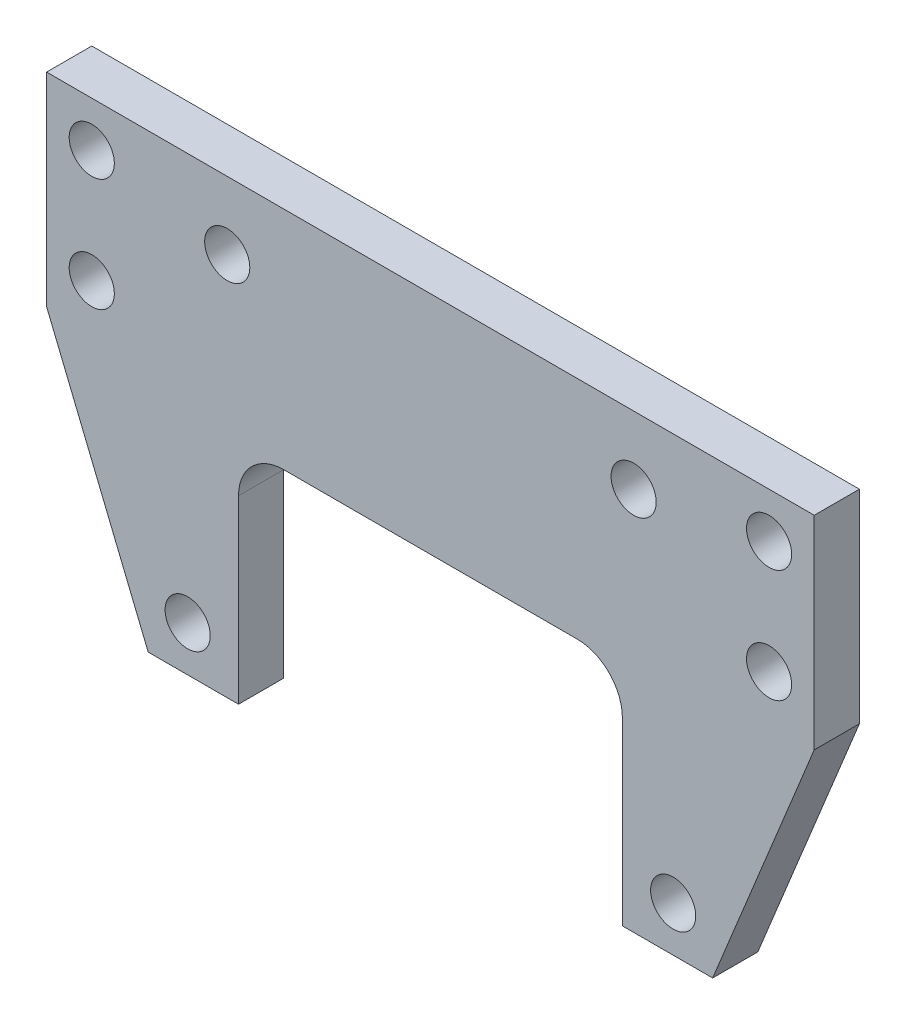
ISO-10303-21;
HEADER;
FILE_DESCRIPTION(('STEP AP214'),'2;1');
FILE_NAME('part.step','',(''),(''),'','','');
FILE_SCHEMA(('AUTOMOTIVE_DESIGN { 1 0 10303 214 1 1 1 1 }'));
ENDSEC;
DATA;
#1=APPLICATION_CONTEXT('core data for automotive mechanical design processes');
#2=APPLICATION_PROTOCOL_DEFINITION('international standard','automotive_design',2000,#1);
#3=PRODUCT_CONTEXT('',#1,'mechanical');
#4=PRODUCT('Part','Part','',(#3));
#5=PRODUCT_RELATED_PRODUCT_CATEGORY('part','',(#4));
#6=PRODUCT_DEFINITION_FORMATION('','',#4);
#7=PRODUCT_DEFINITION_CONTEXT('part definition',#1,'design');
#8=PRODUCT_DEFINITION('design','',#6,#7);
#9=PRODUCT_DEFINITION_SHAPE('','',#8);
#10=(LENGTH_UNIT() NAMED_UNIT(*) SI_UNIT(.MILLI.,.METRE.));
#11=(NAMED_UNIT(*) PLANE_ANGLE_UNIT() SI_UNIT($,.RADIAN.));
#12=(NAMED_UNIT(*) SI_UNIT($,.STERADIAN.) SOLID_ANGLE_UNIT());
#13=UNCERTAINTY_MEASURE_WITH_UNIT(LENGTH_MEASURE(1.E-05),#10,'distance_accuracy_value','');
#14=(GEOMETRIC_REPRESENTATION_CONTEXT(3) GLOBAL_UNCERTAINTY_ASSIGNED_CONTEXT((#13)) GLOBAL_UNIT_ASSIGNED_CONTEXT((#10,
#11,#12)) REPRESENTATION_CONTEXT('',''));
#15=CARTESIAN_POINT('',(0.,0.,0.));
#16=DIRECTION('',(0.,0.,1.));
#17=DIRECTION('',(1.,0.,0.));
#18=AXIS2_PLACEMENT_3D('',#15,#16,#17);
#19=CARTESIAN_POINT('',(0.,0.,6.35));
#20=DIRECTION('',(0.,0.,-1.));
#21=DIRECTION('',(-1.,0.,0.));
#22=AXIS2_PLACEMENT_3D('',#19,#20,#21);
#23=PLANE('',#22);
#24=CARTESIAN_POINT('',(47.625,-6.35,6.35));
#25=DIRECTION('',(0.,0.,1.));
#26=DIRECTION('',(1.,0.,0.));
#27=AXIS2_PLACEMENT_3D('',#24,#25,#26);
#28=CIRCLE('',#27,3.175);
#29=CARTESIAN_POINT('',(50.8,-6.35,6.35));
#30=VERTEX_POINT('',#29);
#31=EDGE_CURVE('E318',#30,#30,#28,.T.);
#32=ORIENTED_EDGE('',*,*,#31,.F.);
#33=EDGE_LOOP('',(#32));
#34=FACE_BOUND('',#33,.T.);
#35=CARTESIAN_POINT('',(-47.625,-22.225,6.35));
#36=DIRECTION('',(0.,0.,1.));
#37=DIRECTION('',(1.,0.,0.));
#38=AXIS2_PLACEMENT_3D('',#35,#36,#37);
#39=CIRCLE('',#38,3.175);
#40=CARTESIAN_POINT('',(-44.45,-22.225,6.35));
#41=VERTEX_POINT('',#40);
#42=EDGE_CURVE('E306',#41,#41,#39,.T.);
#43=ORIENTED_EDGE('',*,*,#42,.F.);
#44=EDGE_LOOP('',(#43));
#45=FACE_BOUND('',#44,.T.);
#46=CARTESIAN_POINT('',(28.575,-9.525,6.35));
#47=DIRECTION('',(0.,0.,1.));
#48=DIRECTION('',(1.,0.,0.));
#49=AXIS2_PLACEMENT_3D('',#46,#47,#48);
#50=CIRCLE('',#49,3.175);
#51=CARTESIAN_POINT('',(31.75,-9.525,6.35));
#52=VERTEX_POINT('',#51);
#53=EDGE_CURVE('E294',#52,#52,#50,.T.);
#54=ORIENTED_EDGE('',*,*,#53,.F.);
#55=EDGE_LOOP('',(#54));
#56=FACE_BOUND('',#55,.T.);
#57=CARTESIAN_POINT('',(-34.1376,-57.15,6.35));
#58=DIRECTION('',(0.,0.,1.));
#59=DIRECTION('',(1.,0.,0.));
#60=AXIS2_PLACEMENT_3D('',#57,#58,#59);
#61=CIRCLE('',#60,3.175);
#62=CARTESIAN_POINT('',(-30.9626,-57.15,6.35));
#63=VERTEX_POINT('',#62);
#64=EDGE_CURVE('E166',#63,#63,#61,.T.);
#65=ORIENTED_EDGE('',*,*,#64,.F.);
#66=EDGE_LOOP('',(#65));
#67=FACE_BOUND('',#66,.T.);
#68=DIRECTION('',(0.,1.,0.));
#69=VECTOR('',#68,1.);
#70=CARTESIAN_POINT('',(-26.9875,-31.75,6.35));
#71=LINE('',#70,#69);
#72=CARTESIAN_POINT('',(-26.9875,-63.5,6.35));
#73=VERTEX_POINT('',#72);
#74=CARTESIAN_POINT('',(-26.9875,-38.1,6.35));
#75=VERTEX_POINT('',#74);
#76=EDGE_CURVE('E185',#73,#75,#71,.T.);
#77=ORIENTED_EDGE('',*,*,#76,.T.);
#78=CARTESIAN_POINT('',(-20.6375,-38.1,6.35));
#79=DIRECTION('',(0.,0.,-1.));
#80=DIRECTION('',(-1.,0.,0.));
#81=AXIS2_PLACEMENT_3D('',#78,#79,#80);
#82=CIRCLE('',#81,6.35);
#83=CARTESIAN_POINT('',(-20.6375,-31.75,6.35));
#84=VERTEX_POINT('',#83);
#85=EDGE_CURVE('E11',#75,#84,#82,.T.);
#86=ORIENTED_EDGE('',*,*,#85,.T.);
#87=DIRECTION('',(1.,0.,0.));
#88=VECTOR('',#87,1.);
#89=CARTESIAN_POINT('',(26.9875,-31.75,6.35));
#90=LINE('',#89,#88);
#91=CARTESIAN_POINT('',(20.6375,-31.75,6.35));
#92=VERTEX_POINT('',#91);
#93=EDGE_CURVE('E132',#84,#92,#90,.T.);
#94=ORIENTED_EDGE('',*,*,#93,.T.);
#95=CARTESIAN_POINT('',(20.6375,-38.1,6.35));
#96=DIRECTION('',(0.,0.,-1.));
#97=DIRECTION('',(-1.,0.,0.));
#98=AXIS2_PLACEMENT_3D('',#95,#96,#97);
#99=CIRCLE('',#98,6.35);
#100=CARTESIAN_POINT('',(26.9875,-38.1,6.35));
#101=VERTEX_POINT('',#100);
#102=EDGE_CURVE('E128',#92,#101,#99,.T.);
#103=ORIENTED_EDGE('',*,*,#102,.T.);
#104=DIRECTION('',(0.,-1.,0.));
#105=VECTOR('',#104,1.);
#106=CARTESIAN_POINT('',(26.9875,-63.5,6.35));
#107=LINE('',#106,#105);
#108=CARTESIAN_POINT('',(26.9875,-63.5,6.35));
#109=VERTEX_POINT('',#108);
#110=EDGE_CURVE('E120',#101,#109,#107,.T.);
#111=ORIENTED_EDGE('',*,*,#110,.T.);
#112=DIRECTION('',(1.,0.,0.));
#113=VECTOR('',#112,1.);
#114=CARTESIAN_POINT('',(39.6875,-63.5,6.35));
#115=LINE('',#114,#113);
#116=CARTESIAN_POINT('',(39.6875,-63.5,6.35));
#117=VERTEX_POINT('',#116);
#118=EDGE_CURVE('E124',#109,#117,#115,.T.);
#119=ORIENTED_EDGE('',*,*,#118,.T.);
#120=DIRECTION('',(0.378632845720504,0.925546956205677,0.));
#121=VECTOR('',#120,1.);
#122=CARTESIAN_POINT('',(39.6875,-63.5,6.35));
#123=LINE('',#122,#121);
#124=CARTESIAN_POINT('',(53.975,-28.575,6.35));
#125=VERTEX_POINT('',#124);
#126=EDGE_CURVE('E147',#117,#125,#123,.T.);
#127=ORIENTED_EDGE('',*,*,#126,.T.);
#128=DIRECTION('',(0.,1.,0.));
#129=VECTOR('',#128,1.);
#130=CARTESIAN_POINT('',(53.975,0.,6.35));
#131=LINE('',#130,#129);
#132=CARTESIAN_POINT('',(53.975,0.,6.35));
#133=VERTEX_POINT('',#132);
#134=EDGE_CURVE('E149',#125,#133,#131,.T.);
#135=ORIENTED_EDGE('',*,*,#134,.T.);
#136=DIRECTION('',(-1.,0.,0.));
#137=VECTOR('',#136,1.);
#138=CARTESIAN_POINT('',(0.,0.,6.35));
#139=LINE('',#138,#137);
#140=CARTESIAN_POINT('',(-53.975,0.,6.35));
#141=VERTEX_POINT('',#140);
#142=EDGE_CURVE('E154',#133,#141,#139,.T.);
#143=ORIENTED_EDGE('',*,*,#142,.T.);
#144=DIRECTION('',(0.,-1.,0.));
#145=VECTOR('',#144,1.);
#146=CARTESIAN_POINT('',(-53.975,-28.575,6.35));
#147=LINE('',#146,#145);
#148=CARTESIAN_POINT('',(-53.975,-28.575,6.35));
#149=VERTEX_POINT('',#148);
#150=EDGE_CURVE('E156',#141,#149,#147,.T.);
#151=ORIENTED_EDGE('',*,*,#150,.T.);
#152=DIRECTION('',(0.378632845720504,-0.925546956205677,0.));
#153=VECTOR('',#152,1.);
#154=CARTESIAN_POINT('',(-39.6875,-63.5,6.35));
#155=LINE('',#154,#153);
#156=CARTESIAN_POINT('',(-39.6875,-63.5,6.35));
#157=VERTEX_POINT('',#156);
#158=EDGE_CURVE('E158',#149,#157,#155,.T.);
#159=ORIENTED_EDGE('',*,*,#158,.T.);
#160=DIRECTION('',(1.,0.,0.));
#161=VECTOR('',#160,1.);
#162=CARTESIAN_POINT('',(-26.9875,-63.5,6.35));
#163=LINE('',#162,#161);
#164=EDGE_CURVE('E160',#157,#73,#163,.T.);
#165=ORIENTED_EDGE('',*,*,#164,.T.);
#166=EDGE_LOOP('',(#77,#86,#94,#103,#111,#119,#127,#135,#143,#151,#159,#165));
#167=FACE_BOUND('',#166,.T.);
#168=CARTESIAN_POINT('',(-28.575,-9.525,6.35));
#169=DIRECTION('',(0.,0.,1.));
#170=DIRECTION('',(1.,0.,0.));
#171=AXIS2_PLACEMENT_3D('',#168,#169,#170);
#172=CIRCLE('',#171,3.175);
#173=CARTESIAN_POINT('',(-25.4,-9.525,6.35));
#174=VERTEX_POINT('',#173);
#175=EDGE_CURVE('E288',#174,#174,#172,.T.);
#176=ORIENTED_EDGE('',*,*,#175,.F.);
#177=EDGE_LOOP('',(#176));
#178=FACE_BOUND('',#177,.T.);
#179=CARTESIAN_POINT('',(34.1376,-57.15,6.35));
#180=DIRECTION('',(0.,0.,1.));
#181=DIRECTION('',(1.,0.,0.));
#182=AXIS2_PLACEMENT_3D('',#179,#180,#181);
#183=CIRCLE('',#182,3.175);
#184=CARTESIAN_POINT('',(37.3126,-57.15,6.35));
#185=VERTEX_POINT('',#184);
#186=EDGE_CURVE('E300',#185,#185,#183,.T.);
#187=ORIENTED_EDGE('',*,*,#186,.F.);
#188=EDGE_LOOP('',(#187));
#189=FACE_BOUND('',#188,.T.);
#190=CARTESIAN_POINT('',(-47.625,-6.35,6.35));
#191=DIRECTION('',(0.,0.,1.));
#192=DIRECTION('',(1.,0.,0.));
#193=AXIS2_PLACEMENT_3D('',#190,#191,#192);
#194=CIRCLE('',#193,3.175);
#195=CARTESIAN_POINT('',(-44.45,-6.35,6.35));
#196=VERTEX_POINT('',#195);
#197=EDGE_CURVE('E312',#196,#196,#194,.T.);
#198=ORIENTED_EDGE('',*,*,#197,.F.);
#199=EDGE_LOOP('',(#198));
#200=FACE_BOUND('',#199,.T.);
#201=CARTESIAN_POINT('',(47.625,-22.225,6.35));
#202=DIRECTION('',(0.,0.,1.));
#203=DIRECTION('',(1.,0.,0.));
#204=AXIS2_PLACEMENT_3D('',#201,#202,#203);
#205=CIRCLE('',#204,3.175);
#206=CARTESIAN_POINT('',(50.8,-22.225,6.35));
#207=VERTEX_POINT('',#206);
#208=EDGE_CURVE('E324',#207,#207,#205,.T.);
#209=ORIENTED_EDGE('',*,*,#208,.F.);
#210=EDGE_LOOP('',(#209));
#211=FACE_BOUND('',#210,.T.);
#212=ADVANCED_FACE('F32',(#34,#45,#56,#67,#167,#178,#189,#200,#211),#23,.F.);
#213=CARTESIAN_POINT('',(0.,0.,0.));
#214=DIRECTION('',(0.,0.,-1.));
#215=DIRECTION('',(-1.,0.,0.));
#216=AXIS2_PLACEMENT_3D('',#213,#214,#215);
#217=PLANE('',#216);
#218=CARTESIAN_POINT('',(47.625,-6.35,0.));
#219=DIRECTION('',(0.,0.,1.));
#220=DIRECTION('',(1.,0.,0.));
#221=AXIS2_PLACEMENT_3D('',#218,#219,#220);
#222=CIRCLE('',#221,3.175);
#223=CARTESIAN_POINT('',(50.8,-6.35,0.));
#224=VERTEX_POINT('',#223);
#225=EDGE_CURVE('E321',#224,#224,#222,.T.);
#226=ORIENTED_EDGE('',*,*,#225,.T.);
#227=EDGE_LOOP('',(#226));
#228=FACE_BOUND('',#227,.T.);
#229=CARTESIAN_POINT('',(-47.625,-22.225,0.));
#230=DIRECTION('',(0.,0.,1.));
#231=DIRECTION('',(1.,0.,0.));
#232=AXIS2_PLACEMENT_3D('',#229,#230,#231);
#233=CIRCLE('',#232,3.175);
#234=CARTESIAN_POINT('',(-44.45,-22.225,0.));
#235=VERTEX_POINT('',#234);
#236=EDGE_CURVE('E309',#235,#235,#233,.T.);
#237=ORIENTED_EDGE('',*,*,#236,.T.);
#238=EDGE_LOOP('',(#237));
#239=FACE_BOUND('',#238,.T.);
#240=CARTESIAN_POINT('',(28.575,-9.525,0.));
#241=DIRECTION('',(0.,0.,1.));
#242=DIRECTION('',(1.,0.,0.));
#243=AXIS2_PLACEMENT_3D('',#240,#241,#242);
#244=CIRCLE('',#243,3.175);
#245=CARTESIAN_POINT('',(31.75,-9.525,0.));
#246=VERTEX_POINT('',#245);
#247=EDGE_CURVE('E297',#246,#246,#244,.T.);
#248=ORIENTED_EDGE('',*,*,#247,.T.);
#249=EDGE_LOOP('',(#248));
#250=FACE_BOUND('',#249,.T.);
#251=CARTESIAN_POINT('',(-34.1376,-57.15,0.));
#252=DIRECTION('',(0.,0.,1.));
#253=DIRECTION('',(1.,0.,0.));
#254=AXIS2_PLACEMENT_3D('',#251,#252,#253);
#255=CIRCLE('',#254,3.175);
#256=CARTESIAN_POINT('',(-30.9626,-57.15,0.));
#257=VERTEX_POINT('',#256);
#258=EDGE_CURVE('E285',#257,#257,#255,.T.);
#259=ORIENTED_EDGE('',*,*,#258,.T.);
#260=EDGE_LOOP('',(#259));
#261=FACE_BOUND('',#260,.T.);
#262=DIRECTION('',(0.,1.,0.));
#263=VECTOR('',#262,1.);
#264=CARTESIAN_POINT('',(-26.9875,-31.75,0.));
#265=LINE('',#264,#263);
#266=CARTESIAN_POINT('',(-26.9875,-63.5,0.));
#267=VERTEX_POINT('',#266);
#268=CARTESIAN_POINT('',(-26.9875,-38.1,0.));
#269=VERTEX_POINT('',#268);
#270=EDGE_CURVE('E163',#267,#269,#265,.T.);
#271=ORIENTED_EDGE('',*,*,#270,.F.);
#272=DIRECTION('',(1.,0.,0.));
#273=VECTOR('',#272,1.);
#274=CARTESIAN_POINT('',(-26.9875,-63.5,0.));
#275=LINE('',#274,#273);
#276=CARTESIAN_POINT('',(-39.6875,-63.5,0.));
#277=VERTEX_POINT('',#276);
#278=EDGE_CURVE('E183',#277,#267,#275,.T.);
#279=ORIENTED_EDGE('',*,*,#278,.F.);
#280=DIRECTION('',(0.378632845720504,-0.925546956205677,0.));
#281=VECTOR('',#280,1.);
#282=CARTESIAN_POINT('',(-39.6875,-63.5,0.));
#283=LINE('',#282,#281);
#284=CARTESIAN_POINT('',(-53.975,-28.575,0.));
#285=VERTEX_POINT('',#284);
#286=EDGE_CURVE('E181',#285,#277,#283,.T.);
#287=ORIENTED_EDGE('',*,*,#286,.F.);
#288=DIRECTION('',(0.,-1.,0.));
#289=VECTOR('',#288,1.);
#290=CARTESIAN_POINT('',(-53.975,-28.575,0.));
#291=LINE('',#290,#289);
#292=CARTESIAN_POINT('',(-53.975,0.,0.));
#293=VERTEX_POINT('',#292);
#294=EDGE_CURVE('E179',#293,#285,#291,.T.);
#295=ORIENTED_EDGE('',*,*,#294,.F.);
#296=DIRECTION('',(-1.,0.,0.));
#297=VECTOR('',#296,1.);
#298=CARTESIAN_POINT('',(-53.975,0.,0.));
#299=LINE('',#298,#297);
#300=CARTESIAN_POINT('',(53.975,0.,0.));
#301=VERTEX_POINT('',#300);
#302=EDGE_CURVE('E177',#301,#293,#299,.T.);
#303=ORIENTED_EDGE('',*,*,#302,.F.);
#304=DIRECTION('',(0.,1.,0.));
#305=VECTOR('',#304,1.);
#306=CARTESIAN_POINT('',(53.975,0.,0.));
#307=LINE('',#306,#305);
#308=CARTESIAN_POINT('',(53.975,-28.575,0.));
#309=VERTEX_POINT('',#308);
#310=EDGE_CURVE('E174',#309,#301,#307,.T.);
#311=ORIENTED_EDGE('',*,*,#310,.F.);
#312=DIRECTION('',(0.378632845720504,0.925546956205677,0.));
#313=VECTOR('',#312,1.);
#314=CARTESIAN_POINT('',(39.6875,-63.5,0.));
#315=LINE('',#314,#313);
#316=CARTESIAN_POINT('',(39.6875,-63.5,0.));
#317=VERTEX_POINT('',#316);
#318=EDGE_CURVE('E172',#317,#309,#315,.T.);
#319=ORIENTED_EDGE('',*,*,#318,.F.);
#320=DIRECTION('',(1.,0.,0.));
#321=VECTOR('',#320,1.);
#322=CARTESIAN_POINT('',(39.6875,-63.5,0.));
#323=LINE('',#322,#321);
#324=CARTESIAN_POINT('',(26.9875,-63.5,0.));
#325=VERTEX_POINT('',#324);
#326=EDGE_CURVE('E170',#325,#317,#323,.T.);
#327=ORIENTED_EDGE('',*,*,#326,.F.);
#328=DIRECTION('',(0.,-1.,0.));
#329=VECTOR('',#328,1.);
#330=CARTESIAN_POINT('',(26.9875,-63.5,0.));
#331=LINE('',#330,#329);
#332=CARTESIAN_POINT('',(26.9875,-38.1,0.));
#333=VERTEX_POINT('',#332);
#334=EDGE_CURVE('E138',#333,#325,#331,.T.);
#335=ORIENTED_EDGE('',*,*,#334,.F.);
#336=CARTESIAN_POINT('',(20.6375,-38.1,0.));
#337=DIRECTION('',(0.,0.,-1.));
#338=DIRECTION('',(-1.,0.,0.));
#339=AXIS2_PLACEMENT_3D('',#336,#337,#338);
#340=CIRCLE('',#339,6.35);
#341=CARTESIAN_POINT('',(20.6375,-31.75,0.));
#342=VERTEX_POINT('',#341);
#343=EDGE_CURVE('E211',#333,#342,#340,.F.);
#344=ORIENTED_EDGE('',*,*,#343,.T.);
#345=DIRECTION('',(1.,0.,0.));
#346=VECTOR('',#345,1.);
#347=CARTESIAN_POINT('',(26.9875,-31.75,0.));
#348=LINE('',#347,#346);
#349=CARTESIAN_POINT('',(-20.6375,-31.75,0.));
#350=VERTEX_POINT('',#349);
#351=EDGE_CURVE('E165',#350,#342,#348,.T.);
#352=ORIENTED_EDGE('',*,*,#351,.F.);
#353=CARTESIAN_POINT('',(-20.6375,-38.1,0.));
#354=DIRECTION('',(0.,0.,-1.));
#355=DIRECTION('',(-1.,0.,0.));
#356=AXIS2_PLACEMENT_3D('',#353,#354,#355);
#357=CIRCLE('',#356,6.35);
#358=EDGE_CURVE('E40',#350,#269,#357,.F.);
#359=ORIENTED_EDGE('',*,*,#358,.T.);
#360=EDGE_LOOP('',(#271,#279,#287,#295,#303,#311,#319,#327,#335,#344,#352,#359));
#361=FACE_BOUND('',#360,.T.);
#362=CARTESIAN_POINT('',(-28.575,-9.525,0.));
#363=DIRECTION('',(0.,0.,1.));
#364=DIRECTION('',(1.,0.,0.));
#365=AXIS2_PLACEMENT_3D('',#362,#363,#364);
#366=CIRCLE('',#365,3.175);
#367=CARTESIAN_POINT('',(-25.4,-9.525,0.));
#368=VERTEX_POINT('',#367);
#369=EDGE_CURVE('E291',#368,#368,#366,.T.);
#370=ORIENTED_EDGE('',*,*,#369,.T.);
#371=EDGE_LOOP('',(#370));
#372=FACE_BOUND('',#371,.T.);
#373=CARTESIAN_POINT('',(34.1376,-57.15,0.));
#374=DIRECTION('',(0.,0.,1.));
#375=DIRECTION('',(1.,0.,0.));
#376=AXIS2_PLACEMENT_3D('',#373,#374,#375);
#377=CIRCLE('',#376,3.175);
#378=CARTESIAN_POINT('',(37.3126,-57.15,0.));
#379=VERTEX_POINT('',#378);
#380=EDGE_CURVE('E303',#379,#379,#377,.T.);
#381=ORIENTED_EDGE('',*,*,#380,.T.);
#382=EDGE_LOOP('',(#381));
#383=FACE_BOUND('',#382,.T.);
#384=CARTESIAN_POINT('',(-47.625,-6.35,0.));
#385=DIRECTION('',(0.,0.,1.));
#386=DIRECTION('',(1.,0.,0.));
#387=AXIS2_PLACEMENT_3D('',#384,#385,#386);
#388=CIRCLE('',#387,3.175);
#389=CARTESIAN_POINT('',(-44.45,-6.35,0.));
#390=VERTEX_POINT('',#389);
#391=EDGE_CURVE('E315',#390,#390,#388,.T.);
#392=ORIENTED_EDGE('',*,*,#391,.T.);
#393=EDGE_LOOP('',(#392));
#394=FACE_BOUND('',#393,.T.);
#395=CARTESIAN_POINT('',(47.625,-22.225,0.));
#396=DIRECTION('',(0.,0.,1.));
#397=DIRECTION('',(1.,0.,0.));
#398=AXIS2_PLACEMENT_3D('',#395,#396,#397);
#399=CIRCLE('',#398,3.175);
#400=CARTESIAN_POINT('',(50.8,-22.225,0.));
#401=VERTEX_POINT('',#400);
#402=EDGE_CURVE('E327',#401,#401,#399,.T.);
#403=ORIENTED_EDGE('',*,*,#402,.T.);
#404=EDGE_LOOP('',(#403));
#405=FACE_BOUND('',#404,.T.);
#406=ADVANCED_FACE('F213',(#228,#239,#250,#261,#361,#372,#383,#394,#405),#217,.T.);
#407=CARTESIAN_POINT('',(-26.9875,-31.75,6.35));
#408=DIRECTION('',(-1.,0.,0.));
#409=DIRECTION('',(0.,0.,1.));
#410=AXIS2_PLACEMENT_3D('',#407,#408,#409);
#411=PLANE('',#410);
#412=ORIENTED_EDGE('',*,*,#270,.T.);
#413=DIRECTION('',(0.,0.,-1.));
#414=VECTOR('',#413,1.);
#415=CARTESIAN_POINT('',(-26.9875,-38.1,6.35));
#416=LINE('',#415,#414);
#417=EDGE_CURVE('E47',#269,#75,#416,.F.);
#418=ORIENTED_EDGE('',*,*,#417,.T.);
#419=ORIENTED_EDGE('',*,*,#76,.F.);
#420=DIRECTION('',(0.,0.,-1.));
#421=VECTOR('',#420,1.);
#422=CARTESIAN_POINT('',(-26.9875,-63.5,6.35));
#423=LINE('',#422,#421);
#424=EDGE_CURVE('E162',#73,#267,#423,.T.);
#425=ORIENTED_EDGE('',*,*,#424,.T.);
#426=EDGE_LOOP('',(#412,#418,#419,#425));
#427=FACE_BOUND('',#426,.T.);
#428=ADVANCED_FACE('F239',(#427),#411,.F.);
#429=CARTESIAN_POINT('',(26.9875,-31.75,6.35));
#430=DIRECTION('',(0.,1.,0.));
#431=DIRECTION('',(0.,0.,1.));
#432=AXIS2_PLACEMENT_3D('',#429,#430,#431);
#433=PLANE('',#432);
#434=ORIENTED_EDGE('',*,*,#351,.T.);
#435=DIRECTION('',(0.,0.,-1.));
#436=VECTOR('',#435,1.);
#437=CARTESIAN_POINT('',(20.6375,-31.75,6.35));
#438=LINE('',#437,#436);
#439=EDGE_CURVE('E208',#342,#92,#438,.F.);
#440=ORIENTED_EDGE('',*,*,#439,.T.);
#441=ORIENTED_EDGE('',*,*,#93,.F.);
#442=DIRECTION('',(0.,0.,-1.));
#443=VECTOR('',#442,1.);
#444=CARTESIAN_POINT('',(-20.6375,-31.75,0.));
#445=LINE('',#444,#443);
#446=EDGE_CURVE('E205',#84,#350,#445,.T.);
#447=ORIENTED_EDGE('',*,*,#446,.T.);
#448=EDGE_LOOP('',(#434,#440,#441,#447));
#449=FACE_BOUND('',#448,.T.);
#450=ADVANCED_FACE('F218',(#449),#433,.F.);
#451=CARTESIAN_POINT('',(26.9875,-63.5,6.35));
#452=DIRECTION('',(1.,0.,0.));
#453=DIRECTION('',(0.,0.,-1.));
#454=AXIS2_PLACEMENT_3D('',#451,#452,#453);
#455=PLANE('',#454);
#456=ORIENTED_EDGE('',*,*,#110,.F.);
#457=DIRECTION('',(0.,0.,-1.));
#458=VECTOR('',#457,1.);
#459=CARTESIAN_POINT('',(26.9875,-38.1,0.));
#460=LINE('',#459,#458);
#461=EDGE_CURVE('E141',#101,#333,#460,.T.);
#462=ORIENTED_EDGE('',*,*,#461,.T.);
#463=ORIENTED_EDGE('',*,*,#334,.T.);
#464=DIRECTION('',(0.,0.,-1.));
#465=VECTOR('',#464,1.);
#466=CARTESIAN_POINT('',(26.9875,-63.5,6.35));
#467=LINE('',#466,#465);
#468=EDGE_CURVE('E135',#109,#325,#467,.T.);
#469=ORIENTED_EDGE('',*,*,#468,.F.);
#470=EDGE_LOOP('',(#456,#462,#463,#469));
#471=FACE_BOUND('',#470,.T.);
#472=ADVANCED_FACE('F136',(#471),#455,.F.);
#473=CARTESIAN_POINT('',(39.6875,-63.5,6.35));
#474=DIRECTION('',(0.,1.,0.));
#475=DIRECTION('',(0.,0.,1.));
#476=AXIS2_PLACEMENT_3D('',#473,#474,#475);
#477=PLANE('',#476);
#478=ORIENTED_EDGE('',*,*,#326,.T.);
#479=DIRECTION('',(0.,0.,-1.));
#480=VECTOR('',#479,1.);
#481=CARTESIAN_POINT('',(39.6875,-63.5,6.35));
#482=LINE('',#481,#480);
#483=EDGE_CURVE('E142',#117,#317,#482,.T.);
#484=ORIENTED_EDGE('',*,*,#483,.F.);
#485=ORIENTED_EDGE('',*,*,#118,.F.);
#486=ORIENTED_EDGE('',*,*,#468,.T.);
#487=EDGE_LOOP('',(#478,#484,#485,#486));
#488=FACE_BOUND('',#487,.T.);
#489=ADVANCED_FACE('F144',(#488),#477,.F.);
#490=CARTESIAN_POINT('',(39.6875,-63.5,6.35));
#491=DIRECTION('',(-0.925546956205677,0.378632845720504,0.));
#492=DIRECTION('',(-0.378632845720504,-0.925546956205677,0.));
#493=AXIS2_PLACEMENT_3D('',#490,#491,#492);
#494=PLANE('',#493);
#495=ORIENTED_EDGE('',*,*,#318,.T.);
#496=DIRECTION('',(0.,0.,-1.));
#497=VECTOR('',#496,1.);
#498=CARTESIAN_POINT('',(53.975,-28.575,6.35));
#499=LINE('',#498,#497);
#500=EDGE_CURVE('E200',#125,#309,#499,.T.);
#501=ORIENTED_EDGE('',*,*,#500,.F.);
#502=ORIENTED_EDGE('',*,*,#126,.F.);
#503=ORIENTED_EDGE('',*,*,#483,.T.);
#504=EDGE_LOOP('',(#495,#501,#502,#503));
#505=FACE_BOUND('',#504,.T.);
#506=ADVANCED_FACE('F267',(#505),#494,.F.);
#507=CARTESIAN_POINT('',(53.975,0.,6.35));
#508=DIRECTION('',(-1.,0.,0.));
#509=DIRECTION('',(0.,0.,1.));
#510=AXIS2_PLACEMENT_3D('',#507,#508,#509);
#511=PLANE('',#510);
#512=ORIENTED_EDGE('',*,*,#310,.T.);
#513=DIRECTION('',(0.,0.,-1.));
#514=VECTOR('',#513,1.);
#515=CARTESIAN_POINT('',(53.975,0.,6.35));
#516=LINE('',#515,#514);
#517=EDGE_CURVE('E197',#133,#301,#516,.T.);
#518=ORIENTED_EDGE('',*,*,#517,.F.);
#519=ORIENTED_EDGE('',*,*,#134,.F.);
#520=ORIENTED_EDGE('',*,*,#500,.T.);
#521=EDGE_LOOP('',(#512,#518,#519,#520));
#522=FACE_BOUND('',#521,.T.);
#523=ADVANCED_FACE('F263',(#522),#511,.F.);
#524=CARTESIAN_POINT('',(-53.975,0.,6.35));
#525=DIRECTION('',(0.,-1.,0.));
#526=DIRECTION('',(0.,0.,-1.));
#527=AXIS2_PLACEMENT_3D('',#524,#525,#526);
#528=PLANE('',#527);
#529=ORIENTED_EDGE('',*,*,#302,.T.);
#530=DIRECTION('',(0.,0.,-1.));
#531=VECTOR('',#530,1.);
#532=CARTESIAN_POINT('',(-53.975,0.,6.35));
#533=LINE('',#532,#531);
#534=EDGE_CURVE('E194',#141,#293,#533,.T.);
#535=ORIENTED_EDGE('',*,*,#534,.F.);
#536=ORIENTED_EDGE('',*,*,#142,.F.);
#537=ORIENTED_EDGE('',*,*,#517,.T.);
#538=EDGE_LOOP('',(#529,#535,#536,#537));
#539=FACE_BOUND('',#538,.T.);
#540=ADVANCED_FACE('F259',(#539),#528,.F.);
#541=CARTESIAN_POINT('',(-53.975,-28.575,6.35));
#542=DIRECTION('',(1.,0.,0.));
#543=DIRECTION('',(0.,0.,-1.));
#544=AXIS2_PLACEMENT_3D('',#541,#542,#543);
#545=PLANE('',#544);
#546=ORIENTED_EDGE('',*,*,#294,.T.);
#547=DIRECTION('',(0.,0.,-1.));
#548=VECTOR('',#547,1.);
#549=CARTESIAN_POINT('',(-53.975,-28.575,6.35));
#550=LINE('',#549,#548);
#551=EDGE_CURVE('E191',#149,#285,#550,.T.);
#552=ORIENTED_EDGE('',*,*,#551,.F.);
#553=ORIENTED_EDGE('',*,*,#150,.F.);
#554=ORIENTED_EDGE('',*,*,#534,.T.);
#555=EDGE_LOOP('',(#546,#552,#553,#554));
#556=FACE_BOUND('',#555,.T.);
#557=ADVANCED_FACE('F255',(#556),#545,.F.);
#558=CARTESIAN_POINT('',(-39.6875,-63.5,6.35));
#559=DIRECTION('',(0.925546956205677,0.378632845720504,0.));
#560=DIRECTION('',(-0.378632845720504,0.925546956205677,0.));
#561=AXIS2_PLACEMENT_3D('',#558,#559,#560);
#562=PLANE('',#561);
#563=ORIENTED_EDGE('',*,*,#286,.T.);
#564=DIRECTION('',(0.,0.,-1.));
#565=VECTOR('',#564,1.);
#566=CARTESIAN_POINT('',(-39.6875,-63.5,6.35));
#567=LINE('',#566,#565);
#568=EDGE_CURVE('E188',#157,#277,#567,.T.);
#569=ORIENTED_EDGE('',*,*,#568,.F.);
#570=ORIENTED_EDGE('',*,*,#158,.F.);
#571=ORIENTED_EDGE('',*,*,#551,.T.);
#572=EDGE_LOOP('',(#563,#569,#570,#571));
#573=FACE_BOUND('',#572,.T.);
#574=ADVANCED_FACE('F251',(#573),#562,.F.);
#575=CARTESIAN_POINT('',(-26.9875,-63.5,6.35));
#576=DIRECTION('',(0.,1.,0.));
#577=DIRECTION('',(0.,0.,1.));
#578=AXIS2_PLACEMENT_3D('',#575,#576,#577);
#579=PLANE('',#578);
#580=ORIENTED_EDGE('',*,*,#278,.T.);
#581=ORIENTED_EDGE('',*,*,#424,.F.);
#582=ORIENTED_EDGE('',*,*,#164,.F.);
#583=ORIENTED_EDGE('',*,*,#568,.T.);
#584=EDGE_LOOP('',(#580,#581,#582,#583));
#585=FACE_BOUND('',#584,.T.);
#586=ADVANCED_FACE('F248',(#585),#579,.F.);
#587=CARTESIAN_POINT('',(-34.1376,-57.15,6.35));
#588=DIRECTION('',(0.,0.,-1.));
#589=DIRECTION('',(-1.,0.,0.));
#590=AXIS2_PLACEMENT_3D('',#587,#588,#589);
#591=CYLINDRICAL_SURFACE('',#590,3.175);
#592=ORIENTED_EDGE('',*,*,#64,.T.);
#593=EDGE_LOOP('',(#592));
#594=FACE_BOUND('',#593,.T.);
#595=ORIENTED_EDGE('',*,*,#258,.F.);
#596=EDGE_LOOP('',(#595));
#597=FACE_BOUND('',#596,.T.);
#598=ADVANCED_FACE('F245',(#594,#597),#591,.F.);
#599=CARTESIAN_POINT('',(-28.575,-9.525,6.35));
#600=DIRECTION('',(0.,0.,-1.));
#601=DIRECTION('',(-1.,0.,0.));
#602=AXIS2_PLACEMENT_3D('',#599,#600,#601);
#603=CYLINDRICAL_SURFACE('',#602,3.175);
#604=ORIENTED_EDGE('',*,*,#175,.T.);
#605=EDGE_LOOP('',(#604));
#606=FACE_BOUND('',#605,.T.);
#607=ORIENTED_EDGE('',*,*,#369,.F.);
#608=EDGE_LOOP('',(#607));
#609=FACE_BOUND('',#608,.T.);
#610=ADVANCED_FACE('F350',(#606,#609),#603,.F.);
#611=CARTESIAN_POINT('',(28.575,-9.525,6.35));
#612=DIRECTION('',(0.,0.,-1.));
#613=DIRECTION('',(-1.,0.,0.));
#614=AXIS2_PLACEMENT_3D('',#611,#612,#613);
#615=CYLINDRICAL_SURFACE('',#614,3.175);
#616=ORIENTED_EDGE('',*,*,#53,.T.);
#617=EDGE_LOOP('',(#616));
#618=FACE_BOUND('',#617,.T.);
#619=ORIENTED_EDGE('',*,*,#247,.F.);
#620=EDGE_LOOP('',(#619));
#621=FACE_BOUND('',#620,.T.);
#622=ADVANCED_FACE('F355',(#618,#621),#615,.F.);
#623=CARTESIAN_POINT('',(34.1376,-57.15,6.35));
#624=DIRECTION('',(0.,0.,-1.));
#625=DIRECTION('',(-1.,0.,0.));
#626=AXIS2_PLACEMENT_3D('',#623,#624,#625);
#627=CYLINDRICAL_SURFACE('',#626,3.175);
#628=ORIENTED_EDGE('',*,*,#186,.T.);
#629=EDGE_LOOP('',(#628));
#630=FACE_BOUND('',#629,.T.);
#631=ORIENTED_EDGE('',*,*,#380,.F.);
#632=EDGE_LOOP('',(#631));
#633=FACE_BOUND('',#632,.T.);
#634=ADVANCED_FACE('F362',(#630,#633),#627,.F.);
#635=CARTESIAN_POINT('',(-47.625,-22.225,6.35));
#636=DIRECTION('',(0.,0.,-1.));
#637=DIRECTION('',(-1.,0.,0.));
#638=AXIS2_PLACEMENT_3D('',#635,#636,#637);
#639=CYLINDRICAL_SURFACE('',#638,3.175);
#640=ORIENTED_EDGE('',*,*,#42,.T.);
#641=EDGE_LOOP('',(#640));
#642=FACE_BOUND('',#641,.T.);
#643=ORIENTED_EDGE('',*,*,#236,.F.);
#644=EDGE_LOOP('',(#643));
#645=FACE_BOUND('',#644,.T.);
#646=ADVANCED_FACE('F369',(#642,#645),#639,.F.);
#647=CARTESIAN_POINT('',(-47.625,-6.35,6.35));
#648=DIRECTION('',(0.,0.,-1.));
#649=DIRECTION('',(-1.,0.,0.));
#650=AXIS2_PLACEMENT_3D('',#647,#648,#649);
#651=CYLINDRICAL_SURFACE('',#650,3.175);
#652=ORIENTED_EDGE('',*,*,#197,.T.);
#653=EDGE_LOOP('',(#652));
#654=FACE_BOUND('',#653,.T.);
#655=ORIENTED_EDGE('',*,*,#391,.F.);
#656=EDGE_LOOP('',(#655));
#657=FACE_BOUND('',#656,.T.);
#658=ADVANCED_FACE('F339',(#654,#657),#651,.F.);
#659=CARTESIAN_POINT('',(47.625,-6.35,6.35));
#660=DIRECTION('',(0.,0.,-1.));
#661=DIRECTION('',(-1.,0.,0.));
#662=AXIS2_PLACEMENT_3D('',#659,#660,#661);
#663=CYLINDRICAL_SURFACE('',#662,3.175);
#664=ORIENTED_EDGE('',*,*,#31,.T.);
#665=EDGE_LOOP('',(#664));
#666=FACE_BOUND('',#665,.T.);
#667=ORIENTED_EDGE('',*,*,#225,.F.);
#668=EDGE_LOOP('',(#667));
#669=FACE_BOUND('',#668,.T.);
#670=ADVANCED_FACE('F229',(#666,#669),#663,.F.);
#671=CARTESIAN_POINT('',(47.625,-22.225,6.35));
#672=DIRECTION('',(0.,0.,-1.));
#673=DIRECTION('',(-1.,0.,0.));
#674=AXIS2_PLACEMENT_3D('',#671,#672,#673);
#675=CYLINDRICAL_SURFACE('',#674,3.175);
#676=ORIENTED_EDGE('',*,*,#208,.T.);
#677=EDGE_LOOP('',(#676));
#678=FACE_BOUND('',#677,.T.);
#679=ORIENTED_EDGE('',*,*,#402,.F.);
#680=EDGE_LOOP('',(#679));
#681=FACE_BOUND('',#680,.T.);
#682=ADVANCED_FACE('F223',(#678,#681),#675,.F.);
#683=CARTESIAN_POINT('',(20.6375,-38.1,6.35));
#684=DIRECTION('',(0.,0.,1.));
#685=DIRECTION('',(1.,0.,0.));
#686=AXIS2_PLACEMENT_3D('',#683,#684,#685);
#687=CYLINDRICAL_SURFACE('',#686,6.35);
#688=ORIENTED_EDGE('',*,*,#102,.F.);
#689=ORIENTED_EDGE('',*,*,#439,.F.);
#690=ORIENTED_EDGE('',*,*,#343,.F.);
#691=ORIENTED_EDGE('',*,*,#461,.F.);
#692=EDGE_LOOP('',(#688,#689,#690,#691));
#693=FACE_BOUND('',#692,.T.);
#694=ADVANCED_FACE('F221',(#693),#687,.F.);
#695=CARTESIAN_POINT('',(-20.6375,-38.1,6.35));
#696=DIRECTION('',(0.,0.,1.));
#697=DIRECTION('',(1.,0.,0.));
#698=AXIS2_PLACEMENT_3D('',#695,#696,#697);
#699=CYLINDRICAL_SURFACE('',#698,6.35);
#700=ORIENTED_EDGE('',*,*,#85,.F.);
#701=ORIENTED_EDGE('',*,*,#417,.F.);
#702=ORIENTED_EDGE('',*,*,#358,.F.);
#703=ORIENTED_EDGE('',*,*,#446,.F.);
#704=EDGE_LOOP('',(#700,#701,#702,#703));
#705=FACE_BOUND('',#704,.T.);
#706=ADVANCED_FACE('F34',(#705),#699,.F.);
#707=CLOSED_SHELL('',(#212,#406,#428,#450,#472,#489,#506,#523,#540,#557,#574,#586,#598,#610,
#622,#634,#646,#658,#670,#682,#694,#706));
#708=MANIFOLD_SOLID_BREP('B2',#707);
#709=ADVANCED_BREP_SHAPE_REPRESENTATION('',(#18,#708),#14);
#710=SHAPE_DEFINITION_REPRESENTATION(#9,#709);
ENDSEC;
END-ISO-10303-21;
